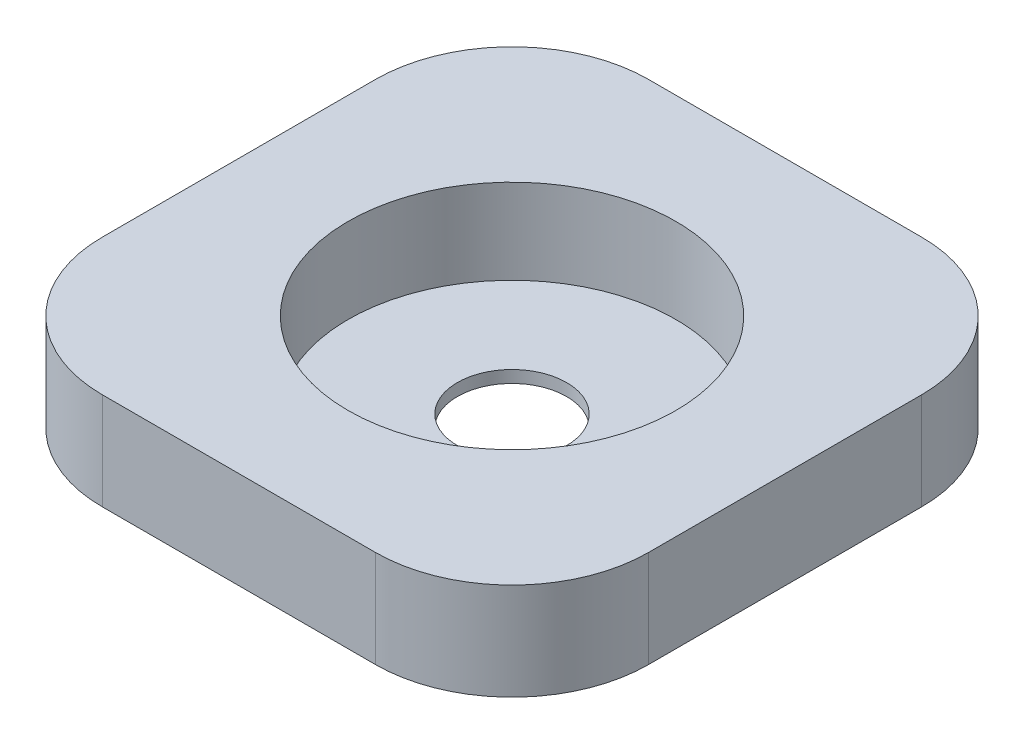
ISO-10303-21;
HEADER;
FILE_DESCRIPTION(('STEP AP214'),'2;1');
FILE_NAME('part.step','',(''),(''),'','','');
FILE_SCHEMA(('AUTOMOTIVE_DESIGN { 1 0 10303 214 1 1 1 1 }'));
ENDSEC;
DATA;
#1=APPLICATION_CONTEXT('core data for automotive mechanical design processes');
#2=APPLICATION_PROTOCOL_DEFINITION('international standard','automotive_design',2000,#1);
#3=PRODUCT_CONTEXT('',#1,'mechanical');
#4=PRODUCT('Part','Part','',(#3));
#5=PRODUCT_RELATED_PRODUCT_CATEGORY('part','',(#4));
#6=PRODUCT_DEFINITION_FORMATION('','',#4);
#7=PRODUCT_DEFINITION_CONTEXT('part definition',#1,'design');
#8=PRODUCT_DEFINITION('design','',#6,#7);
#9=PRODUCT_DEFINITION_SHAPE('','',#8);
#10=(LENGTH_UNIT() NAMED_UNIT(*) SI_UNIT(.MILLI.,.METRE.));
#11=(NAMED_UNIT(*) PLANE_ANGLE_UNIT() SI_UNIT($,.RADIAN.));
#12=(NAMED_UNIT(*) SI_UNIT($,.STERADIAN.) SOLID_ANGLE_UNIT());
#13=UNCERTAINTY_MEASURE_WITH_UNIT(LENGTH_MEASURE(1.E-05),#10,'distance_accuracy_value','');
#14=(GEOMETRIC_REPRESENTATION_CONTEXT(3) GLOBAL_UNCERTAINTY_ASSIGNED_CONTEXT((#13)) GLOBAL_UNIT_ASSIGNED_CONTEXT((#10,
#11,#12)) REPRESENTATION_CONTEXT('',''));
#15=CARTESIAN_POINT('',(0.,0.,0.));
#16=DIRECTION('',(0.,0.,1.));
#17=DIRECTION('',(1.,0.,0.));
#18=AXIS2_PLACEMENT_3D('',#15,#16,#17);
#19=CARTESIAN_POINT('',(11.25,8.,-11.25));
#20=DIRECTION('',(0.,-1.,0.));
#21=DIRECTION('',(0.,0.,-1.));
#22=AXIS2_PLACEMENT_3D('',#19,#20,#21);
#23=CYLINDRICAL_SURFACE('',#22,11.25);
#24=CARTESIAN_POINT('',(11.25,0.,-11.25));
#25=DIRECTION('',(0.,1.,0.));
#26=DIRECTION('',(0.,0.,1.));
#27=AXIS2_PLACEMENT_3D('',#24,#25,#26);
#28=CIRCLE('',#27,11.25);
#29=CARTESIAN_POINT('',(0.,0.,-11.25));
#30=VERTEX_POINT('',#29);
#31=CARTESIAN_POINT('',(11.25,0.,0.));
#32=VERTEX_POINT('',#31);
#33=EDGE_CURVE('E135',#30,#32,#28,.T.);
#34=ORIENTED_EDGE('',*,*,#33,.T.);
#35=DIRECTION('',(0.,-1.,0.));
#36=VECTOR('',#35,1.);
#37=CARTESIAN_POINT('',(11.25,8.,0.));
#38=LINE('',#37,#36);
#39=CARTESIAN_POINT('',(11.25,8.,0.));
#40=VERTEX_POINT('',#39);
#41=EDGE_CURVE('E12',#40,#32,#38,.T.);
#42=ORIENTED_EDGE('',*,*,#41,.F.);
#43=CARTESIAN_POINT('',(11.25,8.,-11.25));
#44=DIRECTION('',(0.,1.,0.));
#45=DIRECTION('',(0.,0.,1.));
#46=AXIS2_PLACEMENT_3D('',#43,#44,#45);
#47=CIRCLE('',#46,11.25);
#48=CARTESIAN_POINT('',(0.,8.,-11.25));
#49=VERTEX_POINT('',#48);
#50=EDGE_CURVE('E150',#49,#40,#47,.T.);
#51=ORIENTED_EDGE('',*,*,#50,.F.);
#52=DIRECTION('',(0.,-1.,0.));
#53=VECTOR('',#52,1.);
#54=CARTESIAN_POINT('',(0.,8.,-11.25));
#55=LINE('',#54,#53);
#56=EDGE_CURVE('E131',#49,#30,#55,.T.);
#57=ORIENTED_EDGE('',*,*,#56,.T.);
#58=EDGE_LOOP('',(#34,#42,#51,#57));
#59=FACE_BOUND('',#58,.T.);
#60=ADVANCED_FACE('F37',(#59),#23,.T.);
#61=CARTESIAN_POINT('',(33.75,8.,0.));
#62=DIRECTION('',(0.,0.,-1.));
#63=DIRECTION('',(-1.,0.,0.));
#64=AXIS2_PLACEMENT_3D('',#61,#62,#63);
#65=PLANE('',#64);
#66=DIRECTION('',(1.,0.,0.));
#67=VECTOR('',#66,1.);
#68=CARTESIAN_POINT('',(33.75,0.,0.));
#69=LINE('',#68,#67);
#70=CARTESIAN_POINT('',(33.75,0.,0.));
#71=VERTEX_POINT('',#70);
#72=EDGE_CURVE('E138',#32,#71,#69,.T.);
#73=ORIENTED_EDGE('',*,*,#72,.T.);
#74=DIRECTION('',(0.,-1.,0.));
#75=VECTOR('',#74,1.);
#76=CARTESIAN_POINT('',(33.75,8.,0.));
#77=LINE('',#76,#75);
#78=CARTESIAN_POINT('',(33.75,8.,0.));
#79=VERTEX_POINT('',#78);
#80=EDGE_CURVE('E46',#79,#71,#77,.T.);
#81=ORIENTED_EDGE('',*,*,#80,.F.);
#82=DIRECTION('',(1.,0.,0.));
#83=VECTOR('',#82,1.);
#84=CARTESIAN_POINT('',(33.75,8.,0.));
#85=LINE('',#84,#83);
#86=EDGE_CURVE('E98',#40,#79,#85,.T.);
#87=ORIENTED_EDGE('',*,*,#86,.F.);
#88=ORIENTED_EDGE('',*,*,#41,.T.);
#89=EDGE_LOOP('',(#73,#81,#87,#88));
#90=FACE_BOUND('',#89,.T.);
#91=ADVANCED_FACE('F209',(#90),#65,.F.);
#92=CARTESIAN_POINT('',(33.75,8.,-11.25));
#93=DIRECTION('',(0.,-1.,0.));
#94=DIRECTION('',(0.,0.,-1.));
#95=AXIS2_PLACEMENT_3D('',#92,#93,#94);
#96=CYLINDRICAL_SURFACE('',#95,11.25);
#97=CARTESIAN_POINT('',(33.75,0.,-11.25));
#98=DIRECTION('',(0.,1.,0.));
#99=DIRECTION('',(0.,0.,1.));
#100=AXIS2_PLACEMENT_3D('',#97,#98,#99);
#101=CIRCLE('',#100,11.25);
#102=CARTESIAN_POINT('',(45.,0.,-11.25));
#103=VERTEX_POINT('',#102);
#104=EDGE_CURVE('E141',#71,#103,#101,.T.);
#105=ORIENTED_EDGE('',*,*,#104,.T.);
#106=DIRECTION('',(0.,-1.,0.));
#107=VECTOR('',#106,1.);
#108=CARTESIAN_POINT('',(45.,8.,-11.25));
#109=LINE('',#108,#107);
#110=CARTESIAN_POINT('',(45.,8.,-11.25));
#111=VERTEX_POINT('',#110);
#112=EDGE_CURVE('E157',#111,#103,#109,.T.);
#113=ORIENTED_EDGE('',*,*,#112,.F.);
#114=CARTESIAN_POINT('',(33.75,8.,-11.25));
#115=DIRECTION('',(0.,1.,0.));
#116=DIRECTION('',(0.,0.,1.));
#117=AXIS2_PLACEMENT_3D('',#114,#115,#116);
#118=CIRCLE('',#117,11.25);
#119=EDGE_CURVE('E176',#79,#111,#118,.T.);
#120=ORIENTED_EDGE('',*,*,#119,.F.);
#121=ORIENTED_EDGE('',*,*,#80,.T.);
#122=EDGE_LOOP('',(#105,#113,#120,#121));
#123=FACE_BOUND('',#122,.T.);
#124=ADVANCED_FACE('F213',(#123),#96,.T.);
#125=CARTESIAN_POINT('',(45.,8.,-33.75));
#126=DIRECTION('',(-1.,0.,0.));
#127=DIRECTION('',(0.,0.,1.));
#128=AXIS2_PLACEMENT_3D('',#125,#126,#127);
#129=PLANE('',#128);
#130=DIRECTION('',(0.,0.,-1.));
#131=VECTOR('',#130,1.);
#132=CARTESIAN_POINT('',(45.,0.,-33.75));
#133=LINE('',#132,#131);
#134=CARTESIAN_POINT('',(45.,0.,-33.75));
#135=VERTEX_POINT('',#134);
#136=EDGE_CURVE('E143',#103,#135,#133,.T.);
#137=ORIENTED_EDGE('',*,*,#136,.T.);
#138=DIRECTION('',(0.,-1.,0.));
#139=VECTOR('',#138,1.);
#140=CARTESIAN_POINT('',(45.,8.,-33.75));
#141=LINE('',#140,#139);
#142=CARTESIAN_POINT('',(45.,8.,-33.75));
#143=VERTEX_POINT('',#142);
#144=EDGE_CURVE('E154',#143,#135,#141,.T.);
#145=ORIENTED_EDGE('',*,*,#144,.F.);
#146=DIRECTION('',(0.,0.,-1.));
#147=VECTOR('',#146,1.);
#148=CARTESIAN_POINT('',(45.,8.,-33.75));
#149=LINE('',#148,#147);
#150=EDGE_CURVE('E178',#111,#143,#149,.T.);
#151=ORIENTED_EDGE('',*,*,#150,.F.);
#152=ORIENTED_EDGE('',*,*,#112,.T.);
#153=EDGE_LOOP('',(#137,#145,#151,#152));
#154=FACE_BOUND('',#153,.T.);
#155=ADVANCED_FACE('F184',(#154),#129,.F.);
#156=CARTESIAN_POINT('',(33.75,8.,-33.75));
#157=DIRECTION('',(0.,-1.,0.));
#158=DIRECTION('',(0.,0.,-1.));
#159=AXIS2_PLACEMENT_3D('',#156,#157,#158);
#160=CYLINDRICAL_SURFACE('',#159,11.25);
#161=CARTESIAN_POINT('',(33.75,0.,-33.75));
#162=DIRECTION('',(0.,1.,0.));
#163=DIRECTION('',(0.,0.,-1.));
#164=AXIS2_PLACEMENT_3D('',#161,#162,#163);
#165=CIRCLE('',#164,11.25);
#166=CARTESIAN_POINT('',(33.75,0.,-45.));
#167=VERTEX_POINT('',#166);
#168=EDGE_CURVE('E145',#135,#167,#165,.T.);
#169=ORIENTED_EDGE('',*,*,#168,.T.);
#170=DIRECTION('',(0.,-1.,0.));
#171=VECTOR('',#170,1.);
#172=CARTESIAN_POINT('',(33.75,8.,-45.));
#173=LINE('',#172,#171);
#174=CARTESIAN_POINT('',(33.75,8.,-45.));
#175=VERTEX_POINT('',#174);
#176=EDGE_CURVE('E126',#175,#167,#173,.T.);
#177=ORIENTED_EDGE('',*,*,#176,.F.);
#178=CARTESIAN_POINT('',(33.75,8.,-33.75));
#179=DIRECTION('',(0.,1.,0.));
#180=DIRECTION('',(0.,0.,-1.));
#181=AXIS2_PLACEMENT_3D('',#178,#179,#180);
#182=CIRCLE('',#181,11.25);
#183=EDGE_CURVE('E117',#143,#175,#182,.T.);
#184=ORIENTED_EDGE('',*,*,#183,.F.);
#185=ORIENTED_EDGE('',*,*,#144,.T.);
#186=EDGE_LOOP('',(#169,#177,#184,#185));
#187=FACE_BOUND('',#186,.T.);
#188=ADVANCED_FACE('F188',(#187),#160,.T.);
#189=CARTESIAN_POINT('',(11.25,8.,-45.));
#190=DIRECTION('',(0.,0.,1.));
#191=DIRECTION('',(1.,0.,0.));
#192=AXIS2_PLACEMENT_3D('',#189,#190,#191);
#193=PLANE('',#192);
#194=DIRECTION('',(-1.,0.,0.));
#195=VECTOR('',#194,1.);
#196=CARTESIAN_POINT('',(11.25,0.,-45.));
#197=LINE('',#196,#195);
#198=CARTESIAN_POINT('',(11.25,0.,-45.));
#199=VERTEX_POINT('',#198);
#200=EDGE_CURVE('E125',#167,#199,#197,.T.);
#201=ORIENTED_EDGE('',*,*,#200,.T.);
#202=DIRECTION('',(0.,-1.,0.));
#203=VECTOR('',#202,1.);
#204=CARTESIAN_POINT('',(11.25,8.,-45.));
#205=LINE('',#204,#203);
#206=CARTESIAN_POINT('',(11.25,8.,-45.));
#207=VERTEX_POINT('',#206);
#208=EDGE_CURVE('E122',#207,#199,#205,.T.);
#209=ORIENTED_EDGE('',*,*,#208,.F.);
#210=DIRECTION('',(-1.,0.,0.));
#211=VECTOR('',#210,1.);
#212=CARTESIAN_POINT('',(11.25,8.,-45.));
#213=LINE('',#212,#211);
#214=EDGE_CURVE('E111',#175,#207,#213,.T.);
#215=ORIENTED_EDGE('',*,*,#214,.F.);
#216=ORIENTED_EDGE('',*,*,#176,.T.);
#217=EDGE_LOOP('',(#201,#209,#215,#216));
#218=FACE_BOUND('',#217,.T.);
#219=ADVANCED_FACE('F123',(#218),#193,.F.);
#220=CARTESIAN_POINT('',(11.25,8.,-33.75));
#221=DIRECTION('',(0.,-1.,0.));
#222=DIRECTION('',(0.,0.,-1.));
#223=AXIS2_PLACEMENT_3D('',#220,#221,#222);
#224=CYLINDRICAL_SURFACE('',#223,11.25);
#225=CARTESIAN_POINT('',(11.25,0.,-33.75));
#226=DIRECTION('',(0.,1.,0.));
#227=DIRECTION('',(0.,0.,1.));
#228=AXIS2_PLACEMENT_3D('',#225,#226,#227);
#229=CIRCLE('',#228,11.25);
#230=CARTESIAN_POINT('',(0.,0.,-33.75));
#231=VERTEX_POINT('',#230);
#232=EDGE_CURVE('E84',#199,#231,#229,.T.);
#233=ORIENTED_EDGE('',*,*,#232,.T.);
#234=DIRECTION('',(0.,-1.,0.));
#235=VECTOR('',#234,1.);
#236=CARTESIAN_POINT('',(0.,8.,-33.75));
#237=LINE('',#236,#235);
#238=CARTESIAN_POINT('',(0.,8.,-33.75));
#239=VERTEX_POINT('',#238);
#240=EDGE_CURVE('E127',#239,#231,#237,.T.);
#241=ORIENTED_EDGE('',*,*,#240,.F.);
#242=CARTESIAN_POINT('',(11.25,8.,-33.75));
#243=DIRECTION('',(0.,1.,0.));
#244=DIRECTION('',(0.,0.,1.));
#245=AXIS2_PLACEMENT_3D('',#242,#243,#244);
#246=CIRCLE('',#245,11.25);
#247=EDGE_CURVE('E115',#207,#239,#246,.T.);
#248=ORIENTED_EDGE('',*,*,#247,.F.);
#249=ORIENTED_EDGE('',*,*,#208,.T.);
#250=EDGE_LOOP('',(#233,#241,#248,#249));
#251=FACE_BOUND('',#250,.T.);
#252=ADVANCED_FACE('F129',(#251),#224,.T.);
#253=CARTESIAN_POINT('',(0.,8.,-33.75));
#254=DIRECTION('',(1.,0.,0.));
#255=DIRECTION('',(0.,0.,-1.));
#256=AXIS2_PLACEMENT_3D('',#253,#254,#255);
#257=PLANE('',#256);
#258=DIRECTION('',(0.,0.,1.));
#259=VECTOR('',#258,1.);
#260=CARTESIAN_POINT('',(0.,0.,-33.75));
#261=LINE('',#260,#259);
#262=EDGE_CURVE('E90',#231,#30,#261,.T.);
#263=ORIENTED_EDGE('',*,*,#262,.T.);
#264=ORIENTED_EDGE('',*,*,#56,.F.);
#265=DIRECTION('',(0.,0.,1.));
#266=VECTOR('',#265,1.);
#267=CARTESIAN_POINT('',(0.,8.,-33.75));
#268=LINE('',#267,#266);
#269=EDGE_CURVE('E55',#239,#49,#268,.T.);
#270=ORIENTED_EDGE('',*,*,#269,.F.);
#271=ORIENTED_EDGE('',*,*,#240,.T.);
#272=EDGE_LOOP('',(#263,#264,#270,#271));
#273=FACE_BOUND('',#272,.T.);
#274=ADVANCED_FACE('F196',(#273),#257,.F.);
#275=CARTESIAN_POINT('',(11.25,8.,-11.25));
#276=DIRECTION('',(0.,1.,0.));
#277=DIRECTION('',(0.,0.,1.));
#278=AXIS2_PLACEMENT_3D('',#275,#276,#277);
#279=PLANE('',#278);
#280=CARTESIAN_POINT('',(22.5,8.,-22.5));
#281=DIRECTION('',(0.,1.,0.));
#282=DIRECTION('',(0.,0.,1.));
#283=AXIS2_PLACEMENT_3D('',#280,#281,#282);
#284=CIRCLE('',#283,13.5);
#285=CARTESIAN_POINT('',(22.5,8.,-9.00000000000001));
#286=VERTEX_POINT('',#285);
#287=EDGE_CURVE('E40',#286,#286,#284,.T.);
#288=ORIENTED_EDGE('',*,*,#287,.F.);
#289=EDGE_LOOP('',(#288));
#290=FACE_BOUND('',#289,.T.);
#291=ORIENTED_EDGE('',*,*,#50,.T.);
#292=ORIENTED_EDGE('',*,*,#86,.T.);
#293=ORIENTED_EDGE('',*,*,#119,.T.);
#294=ORIENTED_EDGE('',*,*,#150,.T.);
#295=ORIENTED_EDGE('',*,*,#183,.T.);
#296=ORIENTED_EDGE('',*,*,#214,.T.);
#297=ORIENTED_EDGE('',*,*,#247,.T.);
#298=ORIENTED_EDGE('',*,*,#269,.T.);
#299=EDGE_LOOP('',(#291,#292,#293,#294,#295,#296,#297,#298));
#300=FACE_BOUND('',#299,.T.);
#301=ADVANCED_FACE('F113',(#290,#300),#279,.T.);
#302=CARTESIAN_POINT('',(11.25,0.,-11.25));
#303=DIRECTION('',(0.,1.,0.));
#304=DIRECTION('',(0.,0.,1.));
#305=AXIS2_PLACEMENT_3D('',#302,#303,#304);
#306=PLANE('',#305);
#307=CARTESIAN_POINT('',(22.5,0.,-22.5));
#308=DIRECTION('',(0.,1.,0.));
#309=DIRECTION('',(0.,0.,1.));
#310=AXIS2_PLACEMENT_3D('',#307,#308,#309);
#311=CIRCLE('',#310,4.5);
#312=CARTESIAN_POINT('',(22.5,0.,-18.));
#313=VERTEX_POINT('',#312);
#314=EDGE_CURVE('E139',#313,#313,#311,.F.);
#315=ORIENTED_EDGE('',*,*,#314,.F.);
#316=EDGE_LOOP('',(#315));
#317=FACE_BOUND('',#316,.T.);
#318=ORIENTED_EDGE('',*,*,#33,.F.);
#319=ORIENTED_EDGE('',*,*,#262,.F.);
#320=ORIENTED_EDGE('',*,*,#232,.F.);
#321=ORIENTED_EDGE('',*,*,#200,.F.);
#322=ORIENTED_EDGE('',*,*,#168,.F.);
#323=ORIENTED_EDGE('',*,*,#136,.F.);
#324=ORIENTED_EDGE('',*,*,#104,.F.);
#325=ORIENTED_EDGE('',*,*,#72,.F.);
#326=EDGE_LOOP('',(#318,#319,#320,#321,#322,#323,#324,#325));
#327=FACE_BOUND('',#326,.T.);
#328=ADVANCED_FACE('F191',(#317,#327),#306,.F.);
#329=CARTESIAN_POINT('',(22.5,8.,-22.5));
#330=DIRECTION('',(0.,-1.,0.));
#331=DIRECTION('',(0.,0.,-1.));
#332=AXIS2_PLACEMENT_3D('',#329,#330,#331);
#333=CYLINDRICAL_SURFACE('',#332,4.5);
#334=CARTESIAN_POINT('',(22.5,1.00000000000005,-22.5));
#335=DIRECTION('',(0.,-1.,0.));
#336=DIRECTION('',(0.,0.,-1.));
#337=AXIS2_PLACEMENT_3D('',#334,#335,#336);
#338=CIRCLE('',#337,4.5);
#339=CARTESIAN_POINT('',(22.5,1.00000000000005,-27.));
#340=VERTEX_POINT('',#339);
#341=EDGE_CURVE('E163',#340,#340,#338,.T.);
#342=ORIENTED_EDGE('',*,*,#341,.F.);
#343=EDGE_LOOP('',(#342));
#344=FACE_BOUND('',#343,.T.);
#345=ORIENTED_EDGE('',*,*,#314,.T.);
#346=EDGE_LOOP('',(#345));
#347=FACE_BOUND('',#346,.T.);
#348=ADVANCED_FACE('F245',(#344,#347),#333,.F.);
#349=CARTESIAN_POINT('',(22.5,8.,-22.5));
#350=DIRECTION('',(0.,1.,0.));
#351=DIRECTION('',(0.,0.,1.));
#352=AXIS2_PLACEMENT_3D('',#349,#350,#351);
#353=CYLINDRICAL_SURFACE('',#352,13.5);
#354=ORIENTED_EDGE('',*,*,#287,.T.);
#355=EDGE_LOOP('',(#354));
#356=FACE_BOUND('',#355,.T.);
#357=CARTESIAN_POINT('',(22.5,1.00000000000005,-22.5));
#358=DIRECTION('',(0.,1.,0.));
#359=DIRECTION('',(0.,0.,1.));
#360=AXIS2_PLACEMENT_3D('',#357,#358,#359);
#361=CIRCLE('',#360,13.5);
#362=CARTESIAN_POINT('',(22.5,1.00000000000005,-9.00000000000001));
#363=VERTEX_POINT('',#362);
#364=EDGE_CURVE('E165',#363,#363,#361,.T.);
#365=ORIENTED_EDGE('',*,*,#364,.F.);
#366=EDGE_LOOP('',(#365));
#367=FACE_BOUND('',#366,.T.);
#368=ADVANCED_FACE('F256',(#356,#367),#353,.F.);
#369=CARTESIAN_POINT('',(0.,1.00000000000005,0.));
#370=DIRECTION('',(0.,-1.,0.));
#371=DIRECTION('',(0.,0.,-1.));
#372=AXIS2_PLACEMENT_3D('',#369,#370,#371);
#373=PLANE('',#372);
#374=ORIENTED_EDGE('',*,*,#341,.T.);
#375=EDGE_LOOP('',(#374));
#376=FACE_BOUND('',#375,.T.);
#377=ORIENTED_EDGE('',*,*,#364,.T.);
#378=EDGE_LOOP('',(#377));
#379=FACE_BOUND('',#378,.T.);
#380=ADVANCED_FACE('F266',(#376,#379),#373,.F.);
#381=CLOSED_SHELL('',(#60,#91,#124,#155,#188,#219,#252,#274,#301,#328,#348,#368,#380));
#382=MANIFOLD_SOLID_BREP('B2',#381);
#383=ADVANCED_BREP_SHAPE_REPRESENTATION('',(#18,#382),#14);
#384=SHAPE_DEFINITION_REPRESENTATION(#9,#383);
ENDSEC;
END-ISO-10303-21;
